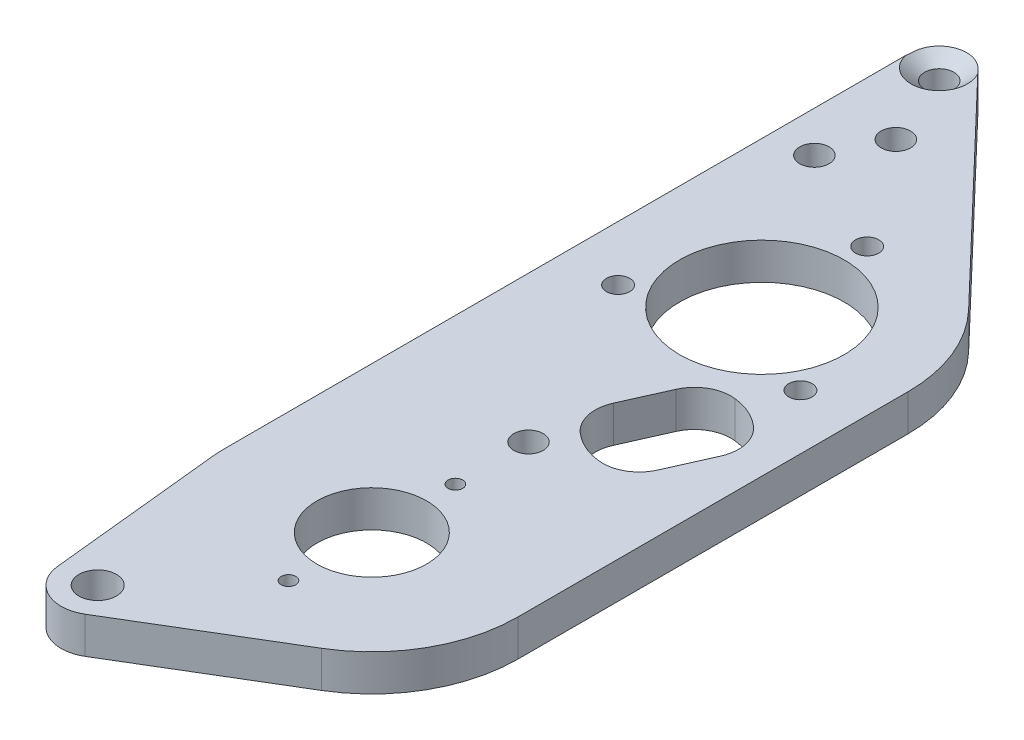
ISO-10303-21;
HEADER;
FILE_DESCRIPTION(('STEP AP214'),'2;1');
FILE_NAME('part.step','',(''),(''),'','','');
FILE_SCHEMA(('AUTOMOTIVE_DESIGN { 1 0 10303 214 1 1 1 1 }'));
ENDSEC;
DATA;
#1=APPLICATION_CONTEXT('core data for automotive mechanical design processes');
#2=APPLICATION_PROTOCOL_DEFINITION('international standard','automotive_design',2000,#1);
#3=PRODUCT_CONTEXT('',#1,'mechanical');
#4=PRODUCT('Part','Part','',(#3));
#5=PRODUCT_RELATED_PRODUCT_CATEGORY('part','',(#4));
#6=PRODUCT_DEFINITION_FORMATION('','',#4);
#7=PRODUCT_DEFINITION_CONTEXT('part definition',#1,'design');
#8=PRODUCT_DEFINITION('design','',#6,#7);
#9=PRODUCT_DEFINITION_SHAPE('','',#8);
#10=(LENGTH_UNIT() NAMED_UNIT(*) SI_UNIT(.MILLI.,.METRE.));
#11=(NAMED_UNIT(*) PLANE_ANGLE_UNIT() SI_UNIT($,.RADIAN.));
#12=(NAMED_UNIT(*) SI_UNIT($,.STERADIAN.) SOLID_ANGLE_UNIT());
#13=UNCERTAINTY_MEASURE_WITH_UNIT(LENGTH_MEASURE(1.E-05),#10,'distance_accuracy_value','');
#14=(GEOMETRIC_REPRESENTATION_CONTEXT(3) GLOBAL_UNCERTAINTY_ASSIGNED_CONTEXT((#13)) GLOBAL_UNIT_ASSIGNED_CONTEXT((#10,
#11,#12)) REPRESENTATION_CONTEXT('',''));
#15=CARTESIAN_POINT('',(0.,0.,0.));
#16=DIRECTION('',(0.,0.,1.));
#17=DIRECTION('',(1.,0.,0.));
#18=AXIS2_PLACEMENT_3D('',#15,#16,#17);
#19=CARTESIAN_POINT('',(0.,6.35,0.));
#20=DIRECTION('',(0.,1.,0.));
#21=DIRECTION('',(0.,0.,1.));
#22=AXIS2_PLACEMENT_3D('',#19,#20,#21);
#23=PLANE('',#22);
#24=CARTESIAN_POINT('',(9.5621274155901,6.35,55.6767999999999));
#25=DIRECTION('',(0.,1.,0.));
#26=DIRECTION('',(0.,0.,1.));
#27=AXIS2_PLACEMENT_3D('',#24,#25,#26);
#28=CIRCLE('',#27,2.01929999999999);
#29=CARTESIAN_POINT('',(9.5621274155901,6.35,57.6960999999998));
#30=VERTEX_POINT('',#29);
#31=EDGE_CURVE('E865',#30,#30,#28,.T.);
#32=ORIENTED_EDGE('',*,*,#31,.F.);
#33=EDGE_LOOP('',(#32));
#34=FACE_BOUND('',#33,.T.);
#35=CARTESIAN_POINT('',(25.4,6.35,28.2448));
#36=DIRECTION('',(0.,1.,0.));
#37=DIRECTION('',(0.,0.,1.));
#38=AXIS2_PLACEMENT_3D('',#35,#36,#37);
#39=CIRCLE('',#38,2.01929999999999);
#40=CARTESIAN_POINT('',(25.4,6.35,30.2641));
#41=VERTEX_POINT('',#40);
#42=EDGE_CURVE('E859',#41,#41,#39,.T.);
#43=ORIENTED_EDGE('',*,*,#42,.F.);
#44=EDGE_LOOP('',(#43));
#45=FACE_BOUND('',#44,.T.);
#46=CARTESIAN_POINT('',(41.2378725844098,6.35,55.6768000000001));
#47=DIRECTION('',(0.,1.,0.));
#48=DIRECTION('',(0.,0.,1.));
#49=AXIS2_PLACEMENT_3D('',#46,#47,#48);
#50=CIRCLE('',#49,2.01929999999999);
#51=CARTESIAN_POINT('',(41.2378725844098,6.35,57.6961000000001));
#52=VERTEX_POINT('',#51);
#53=EDGE_CURVE('E853',#52,#52,#50,.T.);
#54=ORIENTED_EDGE('',*,*,#53,.F.);
#55=EDGE_LOOP('',(#54));
#56=FACE_BOUND('',#55,.T.);
#57=DIRECTION('',(0.406736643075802,0.,-0.9135454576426));
#58=VECTOR('',#57,1.);
#59=CARTESIAN_POINT('',(31.6354975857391,6.35,63.2828955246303));
#60=LINE('',#59,#58);
#61=CARTESIAN_POINT('',(26.9201768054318,6.35,73.8736793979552));
#62=VERTEX_POINT('',#61);
#63=CARTESIAN_POINT('',(30.277390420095,6.35,66.3332541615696));
#64=VERTEX_POINT('',#63);
#65=EDGE_CURVE('E224',#62,#64,#60,.T.);
#66=ORIENTED_EDGE('',*,*,#65,.T.);
#67=CARTESIAN_POINT('',(36.0784040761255,6.35,68.916031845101));
#68=DIRECTION('',(0.,1.,0.));
#69=DIRECTION('',(0.,0.,1.));
#70=AXIS2_PLACEMENT_3D('',#67,#68,#69);
#71=CIRCLE('',#70,6.35);
#72=CARTESIAN_POINT('',(36.8407630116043,6.35,62.611961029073));
#73=VERTEX_POINT('',#72);
#74=EDGE_CURVE('E12',#64,#73,#71,.F.);
#75=ORIENTED_EDGE('',*,*,#74,.T.);
#76=CARTESIAN_POINT('',(35.56,6.35,73.2028));
#77=DIRECTION('',(0.,-1.,0.));
#78=DIRECTION('',(0.,0.,-1.));
#79=AXIS2_PLACEMENT_3D('',#76,#77,#78);
#80=CIRCLE('',#79,10.668);
#81=CARTESIAN_POINT('',(42.573529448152,6.35,65.1643530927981));
#82=VERTEX_POINT('',#81);
#83=EDGE_CURVE('E821',#73,#82,#80,.T.);
#84=ORIENTED_EDGE('',*,*,#83,.T.);
#85=CARTESIAN_POINT('',(38.3988095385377,6.35,69.9491429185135));
#86=DIRECTION('',(0.,1.,0.));
#87=DIRECTION('',(0.,0.,1.));
#88=AXIS2_PLACEMENT_3D('',#85,#86,#87);
#89=CIRCLE('',#88,6.35);
#90=CARTESIAN_POINT('',(44.1998231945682,6.35,72.5319206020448));
#91=VERTEX_POINT('',#90);
#92=EDGE_CURVE('E797',#82,#91,#89,.F.);
#93=ORIENTED_EDGE('',*,*,#92,.T.);
#94=DIRECTION('',(-0.406736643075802,0.,0.9135454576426));
#95=VECTOR('',#94,1.);
#96=CARTESIAN_POINT('',(39.4845024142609,6.35,83.1227044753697));
#97=LINE('',#96,#95);
#98=CARTESIAN_POINT('',(40.842609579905,6.35,80.0723458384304));
#99=VERTEX_POINT('',#98);
#100=EDGE_CURVE('E835',#91,#99,#97,.T.);
#101=ORIENTED_EDGE('',*,*,#100,.T.);
#102=CARTESIAN_POINT('',(35.0415959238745,6.35,77.489568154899));
#103=DIRECTION('',(0.,1.,0.));
#104=DIRECTION('',(0.,0.,1.));
#105=AXIS2_PLACEMENT_3D('',#102,#103,#104);
#106=CIRCLE('',#105,6.35);
#107=CARTESIAN_POINT('',(34.2792369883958,6.35,83.793638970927));
#108=VERTEX_POINT('',#107);
#109=EDGE_CURVE('E809',#99,#108,#106,.F.);
#110=ORIENTED_EDGE('',*,*,#109,.T.);
#111=CARTESIAN_POINT('',(35.56,6.35,73.2028));
#112=DIRECTION('',(0.,-1.,0.));
#113=DIRECTION('',(0.,0.,-1.));
#114=AXIS2_PLACEMENT_3D('',#111,#112,#113);
#115=CIRCLE('',#114,10.668);
#116=CARTESIAN_POINT('',(28.546470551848,6.35,81.2412469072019));
#117=VERTEX_POINT('',#116);
#118=EDGE_CURVE('E839',#108,#117,#115,.T.);
#119=ORIENTED_EDGE('',*,*,#118,.T.);
#120=CARTESIAN_POINT('',(32.7211904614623,6.35,76.4564570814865));
#121=DIRECTION('',(0.,1.,0.));
#122=DIRECTION('',(0.,0.,1.));
#123=AXIS2_PLACEMENT_3D('',#120,#121,#122);
#124=CIRCLE('',#123,6.35);
#125=EDGE_CURVE('E800',#117,#62,#124,.F.);
#126=ORIENTED_EDGE('',*,*,#125,.T.);
#127=EDGE_LOOP('',(#66,#75,#84,#93,#101,#110,#119,#126));
#128=FACE_BOUND('',#127,.T.);
#129=CARTESIAN_POINT('',(4.7625,6.35,-4.91366699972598));
#130=DIRECTION('',(0.,1.,0.));
#131=DIRECTION('',(0.,0.,1.));
#132=AXIS2_PLACEMENT_3D('',#129,#130,#131);
#133=CIRCLE('',#132,4.8895);
#134=CARTESIAN_POINT('',(0.,6.35,-3.80650666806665));
#135=VERTEX_POINT('',#134);
#136=CARTESIAN_POINT('',(8.96985761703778,6.35,-7.40472142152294));
#137=VERTEX_POINT('',#136);
#138=EDGE_CURVE('E206',#135,#137,#133,.T.);
#139=ORIENTED_EDGE('',*,*,#138,.F.);
#140=DIRECTION('',(0.,0.,1.));
#141=VECTOR('',#140,1.);
#142=CARTESIAN_POINT('',(0.,6.35,0.));
#143=LINE('',#142,#141);
#144=CARTESIAN_POINT('',(0.,6.35,114.3));
#145=VERTEX_POINT('',#144);
#146=EDGE_CURVE('E219',#135,#145,#143,.T.);
#147=ORIENTED_EDGE('',*,*,#146,.T.);
#148=CARTESIAN_POINT('',(25.4,6.35,114.3));
#149=DIRECTION('',(0.,-1.,0.));
#150=DIRECTION('',(0.,0.,-1.));
#151=AXIS2_PLACEMENT_3D('',#148,#149,#150);
#152=CIRCLE('',#151,25.4);
#153=CARTESIAN_POINT('',(0.134150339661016,6.35,116.90707516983));
#154=VERTEX_POINT('',#153);
#155=EDGE_CURVE('E411',#154,#145,#152,.T.);
#156=ORIENTED_EDGE('',*,*,#155,.F.);
#157=DIRECTION('',(-0.102640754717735,0.,-0.994718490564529));
#158=VECTOR('',#157,1.);
#159=CARTESIAN_POINT('',(-11.8033182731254,6.35,1.21793402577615));
#160=LINE('',#159,#158);
#161=CARTESIAN_POINT('',(3.20853758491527,6.35,146.701768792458));
#162=VERTEX_POINT('',#161);
#163=EDGE_CURVE('E418',#162,#154,#160,.T.);
#164=ORIENTED_EDGE('',*,*,#163,.F.);
#165=CARTESIAN_POINT('',(9.52500000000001,6.35,146.05));
#166=DIRECTION('',(0.,-1.,0.));
#167=DIRECTION('',(0.,0.,-1.));
#168=AXIS2_PLACEMENT_3D('',#165,#166,#167);
#169=CIRCLE('',#168,6.35000000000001);
#170=CARTESIAN_POINT('',(12.7934624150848,6.35,151.494231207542));
#171=VERTEX_POINT('',#170);
#172=EDGE_CURVE('E424',#171,#162,#169,.T.);
#173=ORIENTED_EDGE('',*,*,#172,.F.);
#174=DIRECTION('',(0.857359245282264,0.,-0.514718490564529));
#175=VECTOR('',#174,1.);
#176=CARTESIAN_POINT('',(70.2436382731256,6.35,117.003825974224));
#177=LINE('',#176,#175);
#178=CARTESIAN_POINT('',(38.473849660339,6.35,136.07692483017));
#179=VERTEX_POINT('',#178);
#180=EDGE_CURVE('E427',#171,#179,#177,.T.);
#181=ORIENTED_EDGE('',*,*,#180,.T.);
#182=CARTESIAN_POINT('',(25.4,6.35,114.3));
#183=DIRECTION('',(0.,-1.,0.));
#184=DIRECTION('',(0.,0.,-1.));
#185=AXIS2_PLACEMENT_3D('',#182,#183,#184);
#186=CIRCLE('',#185,25.4);
#187=CARTESIAN_POINT('',(50.8,6.35,114.3));
#188=VERTEX_POINT('',#187);
#189=EDGE_CURVE('E422',#188,#179,#186,.T.);
#190=ORIENTED_EDGE('',*,*,#189,.F.);
#191=DIRECTION('',(0.,0.,-1.));
#192=VECTOR('',#191,1.);
#193=CARTESIAN_POINT('',(50.8,6.35,0.));
#194=LINE('',#193,#192);
#195=CARTESIAN_POINT('',(50.8,6.35,46.5328));
#196=VERTEX_POINT('',#195);
#197=EDGE_CURVE('E231',#188,#196,#194,.T.);
#198=ORIENTED_EDGE('',*,*,#197,.T.);
#199=CARTESIAN_POINT('',(25.4,6.35,46.5328));
#200=DIRECTION('',(0.,-1.,0.));
#201=DIRECTION('',(0.,0.,-1.));
#202=AXIS2_PLACEMENT_3D('',#199,#200,#201);
#203=CIRCLE('',#202,25.4);
#204=CARTESIAN_POINT('',(43.7584957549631,6.35,28.9792922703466));
#205=VERTEX_POINT('',#204);
#206=EDGE_CURVE('E397',#205,#196,#203,.T.);
#207=ORIENTED_EDGE('',*,*,#206,.F.);
#208=DIRECTION('',(-0.691082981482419,0.,-0.722775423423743));
#209=VECTOR('',#208,1.);
#210=CARTESIAN_POINT('',(8.38453432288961,6.35,-8.01688711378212));
#211=LINE('',#210,#209);
#212=EDGE_CURVE('E223',#205,#137,#211,.T.);
#213=ORIENTED_EDGE('',*,*,#212,.T.);
#214=EDGE_LOOP('',(#139,#147,#156,#164,#173,#181,#190,#198,#207,#213));
#215=FACE_BOUND('',#214,.T.);
#216=CARTESIAN_POINT('',(25.4,6.35,87.07882));
#217=DIRECTION('',(0.,-1.,0.));
#218=DIRECTION('',(0.,0.,-1.));
#219=AXIS2_PLACEMENT_3D('',#216,#217,#218);
#220=CIRCLE('',#219,2.55269999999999);
#221=CARTESIAN_POINT('',(25.4,6.35,84.52612));
#222=VERTEX_POINT('',#221);
#223=EDGE_CURVE('E444',#222,#222,#220,.T.);
#224=ORIENTED_EDGE('',*,*,#223,.T.);
#225=EDGE_LOOP('',(#224));
#226=FACE_BOUND('',#225,.T.);
#227=CARTESIAN_POINT('',(25.4,6.35,99.77882));
#228=DIRECTION('',(0.,-1.,0.));
#229=DIRECTION('',(0.,0.,-1.));
#230=AXIS2_PLACEMENT_3D('',#227,#228,#229);
#231=CIRCLE('',#230,1.27000000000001);
#232=CARTESIAN_POINT('',(25.4,6.35,98.50882));
#233=VERTEX_POINT('',#232);
#234=EDGE_CURVE('E450',#233,#233,#231,.T.);
#235=ORIENTED_EDGE('',*,*,#234,.T.);
#236=EDGE_LOOP('',(#235));
#237=FACE_BOUND('',#236,.T.);
#238=CARTESIAN_POINT('',(25.4,6.35,128.778));
#239=DIRECTION('',(0.,-1.,0.));
#240=DIRECTION('',(0.,0.,-1.));
#241=AXIS2_PLACEMENT_3D('',#238,#239,#240);
#242=CIRCLE('',#241,1.27000000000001);
#243=CARTESIAN_POINT('',(25.4,6.35,127.508));
#244=VERTEX_POINT('',#243);
#245=EDGE_CURVE('E456',#244,#244,#242,.T.);
#246=ORIENTED_EDGE('',*,*,#245,.T.);
#247=EDGE_LOOP('',(#246));
#248=FACE_BOUND('',#247,.T.);
#249=CARTESIAN_POINT('',(7.09951582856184,6.35,19.108793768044));
#250=DIRECTION('',(0.,1.,0.));
#251=DIRECTION('',(0.,0.,1.));
#252=AXIS2_PLACEMENT_3D('',#249,#250,#251);
#253=CIRCLE('',#252,2.5527);
#254=CARTESIAN_POINT('',(7.09951582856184,6.35,21.661493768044));
#255=VERTEX_POINT('',#254);
#256=EDGE_CURVE('E467',#255,#255,#253,.T.);
#257=ORIENTED_EDGE('',*,*,#256,.F.);
#258=EDGE_LOOP('',(#257));
#259=FACE_BOUND('',#258,.T.);
#260=CARTESIAN_POINT('',(11.7863080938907,6.35,9.652));
#261=DIRECTION('',(0.,1.,0.));
#262=DIRECTION('',(0.,0.,1.));
#263=AXIS2_PLACEMENT_3D('',#260,#261,#262);
#264=CIRCLE('',#263,2.5527);
#265=CARTESIAN_POINT('',(11.7863080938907,6.35,12.2047));
#266=VERTEX_POINT('',#265);
#267=EDGE_CURVE('E473',#266,#266,#264,.T.);
#268=ORIENTED_EDGE('',*,*,#267,.F.);
#269=EDGE_LOOP('',(#268));
#270=FACE_BOUND('',#269,.T.);
#271=CARTESIAN_POINT('',(9.52500000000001,6.35,146.05));
#272=DIRECTION('',(0.,1.,0.));
#273=DIRECTION('',(0.,0.,1.));
#274=AXIS2_PLACEMENT_3D('',#271,#272,#273);
#275=CIRCLE('',#274,3.26389999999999);
#276=CARTESIAN_POINT('',(9.52500000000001,6.35,149.3139));
#277=VERTEX_POINT('',#276);
#278=EDGE_CURVE('E254',#277,#277,#275,.T.);
#279=ORIENTED_EDGE('',*,*,#278,.F.);
#280=EDGE_LOOP('',(#279));
#281=FACE_BOUND('',#280,.T.);
#282=CARTESIAN_POINT('',(25.4,6.35,114.3));
#283=DIRECTION('',(0.,1.,0.));
#284=DIRECTION('',(0.,0.,1.));
#285=AXIS2_PLACEMENT_3D('',#282,#283,#284);
#286=CIRCLE('',#285,9.52500000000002);
#287=CARTESIAN_POINT('',(25.4,6.35,123.825));
#288=VERTEX_POINT('',#287);
#289=EDGE_CURVE('E480',#288,#288,#286,.T.);
#290=ORIENTED_EDGE('',*,*,#289,.F.);
#291=EDGE_LOOP('',(#290));
#292=FACE_BOUND('',#291,.T.);
#293=CARTESIAN_POINT('',(25.4,6.35,46.5328));
#294=DIRECTION('',(0.,1.,0.));
#295=DIRECTION('',(0.,0.,1.));
#296=AXIS2_PLACEMENT_3D('',#293,#294,#295);
#297=CIRCLE('',#296,14.2875);
#298=CARTESIAN_POINT('',(25.4,6.35,60.8203));
#299=VERTEX_POINT('',#298);
#300=EDGE_CURVE('E236',#299,#299,#297,.T.);
#301=ORIENTED_EDGE('',*,*,#300,.F.);
#302=EDGE_LOOP('',(#301));
#303=FACE_BOUND('',#302,.T.);
#304=ADVANCED_FACE('F72',(#34,#45,#56,#128,#215,#226,#237,#248,#259,#270,#281,#292,#303),#23,.T.);
#305=CARTESIAN_POINT('',(0.,0.,0.));
#306=DIRECTION('',(0.,1.,0.));
#307=DIRECTION('',(0.,0.,1.));
#308=AXIS2_PLACEMENT_3D('',#305,#306,#307);
#309=PLANE('',#308);
#310=CARTESIAN_POINT('',(9.5621274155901,0.,55.6767999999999));
#311=DIRECTION('',(0.,1.,0.));
#312=DIRECTION('',(0.,0.,1.));
#313=AXIS2_PLACEMENT_3D('',#310,#311,#312);
#314=CIRCLE('',#313,2.0193);
#315=CARTESIAN_POINT('',(9.5621274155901,0.,57.6960999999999));
#316=VERTEX_POINT('',#315);
#317=EDGE_CURVE('E862',#316,#316,#314,.T.);
#318=ORIENTED_EDGE('',*,*,#317,.T.);
#319=EDGE_LOOP('',(#318));
#320=FACE_BOUND('',#319,.T.);
#321=CARTESIAN_POINT('',(25.4,0.,28.2448));
#322=DIRECTION('',(0.,1.,0.));
#323=DIRECTION('',(0.,0.,1.));
#324=AXIS2_PLACEMENT_3D('',#321,#322,#323);
#325=CIRCLE('',#324,2.0193);
#326=CARTESIAN_POINT('',(25.4,0.,30.2641));
#327=VERTEX_POINT('',#326);
#328=EDGE_CURVE('E856',#327,#327,#325,.T.);
#329=ORIENTED_EDGE('',*,*,#328,.T.);
#330=EDGE_LOOP('',(#329));
#331=FACE_BOUND('',#330,.T.);
#332=CARTESIAN_POINT('',(41.2378725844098,0.,55.6768000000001));
#333=DIRECTION('',(0.,1.,0.));
#334=DIRECTION('',(0.,0.,1.));
#335=AXIS2_PLACEMENT_3D('',#332,#333,#334);
#336=CIRCLE('',#335,2.01929999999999);
#337=CARTESIAN_POINT('',(41.2378725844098,0.,57.6961000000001));
#338=VERTEX_POINT('',#337);
#339=EDGE_CURVE('E792',#338,#338,#336,.T.);
#340=ORIENTED_EDGE('',*,*,#339,.T.);
#341=EDGE_LOOP('',(#340));
#342=FACE_BOUND('',#341,.T.);
#343=DIRECTION('',(-0.406736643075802,0.,0.9135454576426));
#344=VECTOR('',#343,1.);
#345=CARTESIAN_POINT('',(39.4845024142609,0.,83.1227044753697));
#346=LINE('',#345,#344);
#347=CARTESIAN_POINT('',(44.1998231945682,0.,72.5319206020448));
#348=VERTEX_POINT('',#347);
#349=CARTESIAN_POINT('',(40.842609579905,0.,80.0723458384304));
#350=VERTEX_POINT('',#349);
#351=EDGE_CURVE('E791',#348,#350,#346,.T.);
#352=ORIENTED_EDGE('',*,*,#351,.F.);
#353=CARTESIAN_POINT('',(38.3988095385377,0.,69.9491429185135));
#354=DIRECTION('',(0.,1.,0.));
#355=DIRECTION('',(0.,0.,1.));
#356=AXIS2_PLACEMENT_3D('',#353,#354,#355);
#357=CIRCLE('',#356,6.35);
#358=CARTESIAN_POINT('',(42.573529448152,0.,65.1643530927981));
#359=VERTEX_POINT('',#358);
#360=EDGE_CURVE('E795',#348,#359,#357,.T.);
#361=ORIENTED_EDGE('',*,*,#360,.T.);
#362=CARTESIAN_POINT('',(35.56,0.,73.2028));
#363=DIRECTION('',(0.,-1.,0.));
#364=DIRECTION('',(0.,0.,-1.));
#365=AXIS2_PLACEMENT_3D('',#362,#363,#364);
#366=CIRCLE('',#365,10.668);
#367=CARTESIAN_POINT('',(36.8407630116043,0.,62.611961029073));
#368=VERTEX_POINT('',#367);
#369=EDGE_CURVE('E787',#368,#359,#366,.T.);
#370=ORIENTED_EDGE('',*,*,#369,.F.);
#371=CARTESIAN_POINT('',(36.0784040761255,0.,68.916031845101));
#372=DIRECTION('',(0.,1.,0.));
#373=DIRECTION('',(0.,0.,1.));
#374=AXIS2_PLACEMENT_3D('',#371,#372,#373);
#375=CIRCLE('',#374,6.35);
#376=CARTESIAN_POINT('',(30.277390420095,0.,66.3332541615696));
#377=VERTEX_POINT('',#376);
#378=EDGE_CURVE('E80',#368,#377,#375,.T.);
#379=ORIENTED_EDGE('',*,*,#378,.T.);
#380=DIRECTION('',(0.406736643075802,0.,-0.9135454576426));
#381=VECTOR('',#380,1.);
#382=CARTESIAN_POINT('',(31.6354975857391,0.,63.2828955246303));
#383=LINE('',#382,#381);
#384=CARTESIAN_POINT('',(26.9201768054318,0.,73.8736793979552));
#385=VERTEX_POINT('',#384);
#386=EDGE_CURVE('E815',#385,#377,#383,.T.);
#387=ORIENTED_EDGE('',*,*,#386,.F.);
#388=CARTESIAN_POINT('',(32.7211904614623,0.,76.4564570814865));
#389=DIRECTION('',(0.,1.,0.));
#390=DIRECTION('',(0.,0.,1.));
#391=AXIS2_PLACEMENT_3D('',#388,#389,#390);
#392=CIRCLE('',#391,6.35);
#393=CARTESIAN_POINT('',(28.546470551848,0.,81.2412469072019));
#394=VERTEX_POINT('',#393);
#395=EDGE_CURVE('E798',#385,#394,#392,.T.);
#396=ORIENTED_EDGE('',*,*,#395,.T.);
#397=CARTESIAN_POINT('',(35.56,0.,73.2028));
#398=DIRECTION('',(0.,-1.,0.));
#399=DIRECTION('',(0.,0.,-1.));
#400=AXIS2_PLACEMENT_3D('',#397,#398,#399);
#401=CIRCLE('',#400,10.668);
#402=CARTESIAN_POINT('',(34.2792369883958,0.,83.793638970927));
#403=VERTEX_POINT('',#402);
#404=EDGE_CURVE('E822',#403,#394,#401,.T.);
#405=ORIENTED_EDGE('',*,*,#404,.F.);
#406=CARTESIAN_POINT('',(35.0415959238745,0.,77.489568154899));
#407=DIRECTION('',(0.,1.,0.));
#408=DIRECTION('',(0.,0.,1.));
#409=AXIS2_PLACEMENT_3D('',#406,#407,#408);
#410=CIRCLE('',#409,6.35);
#411=EDGE_CURVE('E807',#403,#350,#410,.T.);
#412=ORIENTED_EDGE('',*,*,#411,.T.);
#413=EDGE_LOOP('',(#352,#361,#370,#379,#387,#396,#405,#412));
#414=FACE_BOUND('',#413,.T.);
#415=CARTESIAN_POINT('',(4.7625,0.,-4.91366699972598));
#416=DIRECTION('',(0.,-1.,0.));
#417=DIRECTION('',(0.,0.,-1.));
#418=AXIS2_PLACEMENT_3D('',#415,#416,#417);
#419=CIRCLE('',#418,2.5527);
#420=CARTESIAN_POINT('',(4.7625,0.,-7.46636699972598));
#421=VERTEX_POINT('',#420);
#422=EDGE_CURVE('E459',#421,#421,#419,.T.);
#423=ORIENTED_EDGE('',*,*,#422,.F.);
#424=EDGE_LOOP('',(#423));
#425=FACE_BOUND('',#424,.T.);
#426=CARTESIAN_POINT('',(25.4,0.,46.5328));
#427=DIRECTION('',(0.,1.,0.));
#428=DIRECTION('',(0.,0.,1.));
#429=AXIS2_PLACEMENT_3D('',#426,#427,#428);
#430=CIRCLE('',#429,14.2875);
#431=CARTESIAN_POINT('',(25.4,0.,60.8203));
#432=VERTEX_POINT('',#431);
#433=EDGE_CURVE('E247',#432,#432,#430,.T.);
#434=ORIENTED_EDGE('',*,*,#433,.T.);
#435=EDGE_LOOP('',(#434));
#436=FACE_BOUND('',#435,.T.);
#437=CARTESIAN_POINT('',(25.4,0.,114.3));
#438=DIRECTION('',(0.,1.,0.));
#439=DIRECTION('',(0.,0.,1.));
#440=AXIS2_PLACEMENT_3D('',#437,#438,#439);
#441=CIRCLE('',#440,9.52500000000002);
#442=CARTESIAN_POINT('',(25.4,0.,123.825));
#443=VERTEX_POINT('',#442);
#444=EDGE_CURVE('E243',#443,#443,#441,.T.);
#445=ORIENTED_EDGE('',*,*,#444,.T.);
#446=EDGE_LOOP('',(#445));
#447=FACE_BOUND('',#446,.T.);
#448=CARTESIAN_POINT('',(9.52500000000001,0.,146.05));
#449=DIRECTION('',(0.,1.,0.));
#450=DIRECTION('',(0.,0.,1.));
#451=AXIS2_PLACEMENT_3D('',#448,#449,#450);
#452=CIRCLE('',#451,3.26389999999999);
#453=CARTESIAN_POINT('',(9.52500000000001,0.,149.3139));
#454=VERTEX_POINT('',#453);
#455=EDGE_CURVE('E240',#454,#454,#452,.T.);
#456=ORIENTED_EDGE('',*,*,#455,.T.);
#457=EDGE_LOOP('',(#456));
#458=FACE_BOUND('',#457,.T.);
#459=CARTESIAN_POINT('',(11.7863080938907,0.,9.652));
#460=DIRECTION('',(0.,1.,0.));
#461=DIRECTION('',(0.,0.,1.));
#462=AXIS2_PLACEMENT_3D('',#459,#460,#461);
#463=CIRCLE('',#462,2.5527);
#464=CARTESIAN_POINT('',(11.7863080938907,0.,12.2047));
#465=VERTEX_POINT('',#464);
#466=EDGE_CURVE('E244',#465,#465,#463,.T.);
#467=ORIENTED_EDGE('',*,*,#466,.T.);
#468=EDGE_LOOP('',(#467));
#469=FACE_BOUND('',#468,.T.);
#470=CARTESIAN_POINT('',(7.09951582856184,0.,19.108793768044));
#471=DIRECTION('',(0.,1.,0.));
#472=DIRECTION('',(0.,0.,1.));
#473=AXIS2_PLACEMENT_3D('',#470,#471,#472);
#474=CIRCLE('',#473,2.5527);
#475=CARTESIAN_POINT('',(7.09951582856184,0.,21.661493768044));
#476=VERTEX_POINT('',#475);
#477=EDGE_CURVE('E470',#476,#476,#474,.T.);
#478=ORIENTED_EDGE('',*,*,#477,.T.);
#479=EDGE_LOOP('',(#478));
#480=FACE_BOUND('',#479,.T.);
#481=CARTESIAN_POINT('',(25.4,0.,128.778));
#482=DIRECTION('',(0.,-1.,0.));
#483=DIRECTION('',(0.,0.,-1.));
#484=AXIS2_PLACEMENT_3D('',#481,#482,#483);
#485=CIRCLE('',#484,1.27000000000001);
#486=CARTESIAN_POINT('',(25.4,0.,127.508));
#487=VERTEX_POINT('',#486);
#488=EDGE_CURVE('E453',#487,#487,#485,.T.);
#489=ORIENTED_EDGE('',*,*,#488,.F.);
#490=EDGE_LOOP('',(#489));
#491=FACE_BOUND('',#490,.T.);
#492=CARTESIAN_POINT('',(25.4,0.,99.77882));
#493=DIRECTION('',(0.,-1.,0.));
#494=DIRECTION('',(0.,0.,-1.));
#495=AXIS2_PLACEMENT_3D('',#492,#493,#494);
#496=CIRCLE('',#495,1.27000000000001);
#497=CARTESIAN_POINT('',(25.4,0.,98.50882));
#498=VERTEX_POINT('',#497);
#499=EDGE_CURVE('E447',#498,#498,#496,.T.);
#500=ORIENTED_EDGE('',*,*,#499,.F.);
#501=EDGE_LOOP('',(#500));
#502=FACE_BOUND('',#501,.T.);
#503=CARTESIAN_POINT('',(25.4,0.,87.07882));
#504=DIRECTION('',(0.,-1.,0.));
#505=DIRECTION('',(0.,0.,-1.));
#506=AXIS2_PLACEMENT_3D('',#503,#504,#505);
#507=CIRCLE('',#506,2.55269999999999);
#508=CARTESIAN_POINT('',(25.4,0.,84.52612));
#509=VERTEX_POINT('',#508);
#510=EDGE_CURVE('E439',#509,#509,#507,.T.);
#511=ORIENTED_EDGE('',*,*,#510,.F.);
#512=EDGE_LOOP('',(#511));
#513=FACE_BOUND('',#512,.T.);
#514=CARTESIAN_POINT('',(4.7625,0.,-4.91366699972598));
#515=DIRECTION('',(0.,-1.,0.));
#516=DIRECTION('',(0.,0.,-1.));
#517=AXIS2_PLACEMENT_3D('',#514,#515,#516);
#518=CIRCLE('',#517,4.7625);
#519=CARTESIAN_POINT('',(0.,0.,-4.91366699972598));
#520=VERTEX_POINT('',#519);
#521=CARTESIAN_POINT('',(8.20471795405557,0.,-8.204949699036));
#522=VERTEX_POINT('',#521);
#523=EDGE_CURVE('E395',#520,#522,#518,.T.);
#524=ORIENTED_EDGE('',*,*,#523,.T.);
#525=DIRECTION('',(-0.691082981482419,0.,-0.722775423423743));
#526=VECTOR('',#525,1.);
#527=CARTESIAN_POINT('',(8.38453432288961,0.,-8.01688711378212));
#528=LINE('',#527,#526);
#529=CARTESIAN_POINT('',(43.7584957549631,0.,28.9792922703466));
#530=VERTEX_POINT('',#529);
#531=EDGE_CURVE('E389',#530,#522,#528,.T.);
#532=ORIENTED_EDGE('',*,*,#531,.F.);
#533=CARTESIAN_POINT('',(25.4,0.,46.5328));
#534=DIRECTION('',(0.,-1.,0.));
#535=DIRECTION('',(0.,0.,-1.));
#536=AXIS2_PLACEMENT_3D('',#533,#534,#535);
#537=CIRCLE('',#536,25.4);
#538=CARTESIAN_POINT('',(50.8,0.,46.5328));
#539=VERTEX_POINT('',#538);
#540=EDGE_CURVE('E382',#530,#539,#537,.T.);
#541=ORIENTED_EDGE('',*,*,#540,.T.);
#542=DIRECTION('',(0.,0.,-1.));
#543=VECTOR('',#542,1.);
#544=CARTESIAN_POINT('',(50.8,0.,0.));
#545=LINE('',#544,#543);
#546=CARTESIAN_POINT('',(50.8,0.,114.3));
#547=VERTEX_POINT('',#546);
#548=EDGE_CURVE('E250',#547,#539,#545,.T.);
#549=ORIENTED_EDGE('',*,*,#548,.F.);
#550=CARTESIAN_POINT('',(25.4,0.,114.3));
#551=DIRECTION('',(0.,-1.,0.));
#552=DIRECTION('',(0.,0.,-1.));
#553=AXIS2_PLACEMENT_3D('',#550,#551,#552);
#554=CIRCLE('',#553,25.4);
#555=CARTESIAN_POINT('',(38.473849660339,0.,136.07692483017));
#556=VERTEX_POINT('',#555);
#557=EDGE_CURVE('E420',#547,#556,#554,.T.);
#558=ORIENTED_EDGE('',*,*,#557,.T.);
#559=DIRECTION('',(0.857359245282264,0.,-0.514718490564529));
#560=VECTOR('',#559,1.);
#561=CARTESIAN_POINT('',(70.2436382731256,0.,117.003825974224));
#562=LINE('',#561,#560);
#563=CARTESIAN_POINT('',(12.7934624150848,0.,151.494231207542));
#564=VERTEX_POINT('',#563);
#565=EDGE_CURVE('E425',#564,#556,#562,.T.);
#566=ORIENTED_EDGE('',*,*,#565,.F.);
#567=CARTESIAN_POINT('',(9.52500000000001,0.,146.05));
#568=DIRECTION('',(0.,-1.,0.));
#569=DIRECTION('',(0.,0.,-1.));
#570=AXIS2_PLACEMENT_3D('',#567,#568,#569);
#571=CIRCLE('',#570,6.35000000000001);
#572=CARTESIAN_POINT('',(3.20853758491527,0.,146.701768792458));
#573=VERTEX_POINT('',#572);
#574=EDGE_CURVE('E433',#564,#573,#571,.T.);
#575=ORIENTED_EDGE('',*,*,#574,.T.);
#576=DIRECTION('',(-0.102640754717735,0.,-0.994718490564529));
#577=VECTOR('',#576,1.);
#578=CARTESIAN_POINT('',(-11.8033182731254,0.,1.21793402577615));
#579=LINE('',#578,#577);
#580=CARTESIAN_POINT('',(0.134150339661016,0.,116.90707516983));
#581=VERTEX_POINT('',#580);
#582=EDGE_CURVE('E412',#573,#581,#579,.T.);
#583=ORIENTED_EDGE('',*,*,#582,.T.);
#584=CARTESIAN_POINT('',(25.4,0.,114.3));
#585=DIRECTION('',(0.,-1.,0.));
#586=DIRECTION('',(0.,0.,-1.));
#587=AXIS2_PLACEMENT_3D('',#584,#585,#586);
#588=CIRCLE('',#587,25.4);
#589=CARTESIAN_POINT('',(0.,0.,114.3));
#590=VERTEX_POINT('',#589);
#591=EDGE_CURVE('E403',#581,#590,#588,.T.);
#592=ORIENTED_EDGE('',*,*,#591,.T.);
#593=DIRECTION('',(0.,0.,1.));
#594=VECTOR('',#593,1.);
#595=CARTESIAN_POINT('',(0.,0.,0.));
#596=LINE('',#595,#594);
#597=EDGE_CURVE('E253',#520,#590,#596,.T.);
#598=ORIENTED_EDGE('',*,*,#597,.F.);
#599=EDGE_LOOP('',(#524,#532,#541,#549,#558,#566,#575,#583,#592,#598));
#600=FACE_BOUND('',#599,.T.);
#601=ADVANCED_FACE('F285',(#320,#331,#342,#414,#425,#436,#447,#458,#469,#480,#491,#502,#513,
#600),#309,.F.);
#602=CARTESIAN_POINT('',(50.8,6.35,0.));
#603=DIRECTION('',(-1.,0.,0.));
#604=DIRECTION('',(0.,0.,1.));
#605=AXIS2_PLACEMENT_3D('',#602,#603,#604);
#606=PLANE('',#605);
#607=DIRECTION('',(0.,-1.,0.));
#608=VECTOR('',#607,1.);
#609=CARTESIAN_POINT('',(50.8,6.35,46.5328));
#610=LINE('',#609,#608);
#611=EDGE_CURVE('E386',#196,#539,#610,.T.);
#612=ORIENTED_EDGE('',*,*,#611,.F.);
#613=ORIENTED_EDGE('',*,*,#197,.F.);
#614=DIRECTION('',(0.,-1.,0.));
#615=VECTOR('',#614,1.);
#616=CARTESIAN_POINT('',(50.8,6.35,114.3));
#617=LINE('',#616,#615);
#618=EDGE_CURVE('E430',#188,#547,#617,.T.);
#619=ORIENTED_EDGE('',*,*,#618,.T.);
#620=ORIENTED_EDGE('',*,*,#548,.T.);
#621=EDGE_LOOP('',(#612,#613,#619,#620));
#622=FACE_BOUND('',#621,.T.);
#623=ADVANCED_FACE('F284',(#622),#606,.F.);
#624=CARTESIAN_POINT('',(0.,6.35,0.));
#625=DIRECTION('',(1.,0.,0.));
#626=DIRECTION('',(0.,0.,-1.));
#627=AXIS2_PLACEMENT_3D('',#624,#625,#626);
#628=PLANE('',#627);
#629=ORIENTED_EDGE('',*,*,#146,.F.);
#630=CARTESIAN_POINT('',(0.,11.1681087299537,4.59145539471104));
#631=CARTESIAN_POINT('',(0.,11.0108290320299,4.3817790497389));
#632=CARTESIAN_POINT('',(0.,10.8541919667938,4.17161679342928));
#633=CARTESIAN_POINT('',(0.,10.5425192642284,3.75008846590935));
#634=CARTESIAN_POINT('',(0.,10.3874837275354,3.53872232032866));
#635=CARTESIAN_POINT('',(0.,10.0789919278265,3.11408751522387));
#636=CARTESIAN_POINT('',(0.,9.92554017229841,2.90081557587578));
#637=CARTESIAN_POINT('',(0.,9.62103891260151,2.4725686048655));
#638=CARTESIAN_POINT('',(0.,9.46998935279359,2.2575936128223));
#639=CARTESIAN_POINT('',(0.,9.16354623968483,1.81498026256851));
#640=CARTESIAN_POINT('',(0.,9.00830274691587,1.58723775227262));
#641=CARTESIAN_POINT('',(0.,8.70203360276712,1.12893632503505));
#642=CARTESIAN_POINT('',(0.,8.55100780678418,0.898377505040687));
#643=CARTESIAN_POINT('',(0.,8.25459143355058,0.433944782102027));
#644=CARTESIAN_POINT('',(0.,8.10919586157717,0.200074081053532));
#645=CARTESIAN_POINT('',(0.,7.82573809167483,-0.272051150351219));
#646=CARTESIAN_POINT('',(0.,7.68767478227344,-0.510305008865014));
#647=CARTESIAN_POINT('',(0.,7.42513261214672,-0.985759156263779));
#648=CARTESIAN_POINT('',(0.,7.30038548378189,-1.22281002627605));
#649=CARTESIAN_POINT('',(0.,7.0637430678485,-1.70347641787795));
#650=CARTESIAN_POINT('',(0.,6.95185421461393,-1.94709515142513));
#651=CARTESIAN_POINT('',(0.,6.7471653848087,-2.43908265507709));
#652=CARTESIAN_POINT('',(0.,6.65416114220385,-2.68736486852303));
#653=CARTESIAN_POINT('',(0.,6.49220942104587,-3.19150759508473));
#654=CARTESIAN_POINT('',(0.,6.42322743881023,-3.44735666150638));
#655=CARTESIAN_POINT('',(0.,6.32612784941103,-3.91843116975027));
#656=CARTESIAN_POINT('',(0.,6.29285590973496,-4.13256877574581));
#657=CARTESIAN_POINT('',(0.,6.25557790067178,-4.50903998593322));
#658=CARTESIAN_POINT('',(0.,6.24631593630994,-4.67085737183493));
#659=CARTESIAN_POINT('',(0.,6.24170507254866,-4.99472749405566));
#660=CARTESIAN_POINT('',(0.,6.24635840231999,-5.15678026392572));
#661=CARTESIAN_POINT('',(0.,6.26939109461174,-5.48102537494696));
#662=CARTESIAN_POINT('',(0.,6.28786580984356,-5.64321083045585));
#663=CARTESIAN_POINT('',(0.,6.33758560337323,-5.96555716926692));
#664=CARTESIAN_POINT('',(0.,6.36882963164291,-6.12571821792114));
#665=CARTESIAN_POINT('',(0.,6.46546177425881,-6.54202001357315));
#666=CARTESIAN_POINT('',(0.,6.54000596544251,-6.79603439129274));
#667=CARTESIAN_POINT('',(0.,6.71163409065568,-7.29665047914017));
#668=CARTESIAN_POINT('',(0.,6.80876381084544,-7.54323596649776));
#669=CARTESIAN_POINT('',(0.,6.96581952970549,-7.90560138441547));
#670=CARTESIAN_POINT('',(0.,7.01954796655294,-8.02413459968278));
#671=CARTESIAN_POINT('',(0.,7.13041024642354,-8.2596117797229));
#672=CARTESIAN_POINT('',(0.,7.18754432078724,-8.3765556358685));
#673=CARTESIAN_POINT('',(0.,7.30442020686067,-8.60840336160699));
#674=CARTESIAN_POINT('',(0.,7.36414779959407,-8.72331443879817));
#675=CARTESIAN_POINT('',(0.,7.48606100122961,-8.95178789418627));
#676=CARTESIAN_POINT('',(0.,7.54824595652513,-9.06535062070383));
#677=CARTESIAN_POINT('',(0.,7.6114707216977,-9.17832193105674));
#678=B_SPLINE_CURVE_WITH_KNOTS('',3,(#630,#631,#632,#633,#634,#635,#636,#637,#638,#639,#640,
#641,#642,#643,#644,#645,#646,#647,#648,#649,#650,#651,#652,#653,#654,#655,#656,#657,#658,#659,
#660,#661,#662,#663,#664,#665,#666,#667,#668,#669,#670,#671,#672,#673,#674,#675,#676,#677),
.UNSPECIFIED.,.F.,.F.,(4,2,2,2,2,2,2,2,2,2,2,2,2,2,2,2,2,2,2,2,2,2,2,4),(0.,0.786330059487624,
1.5727092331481,2.36091592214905,3.14910432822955,3.97593251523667,4.8027323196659,
5.62878101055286,6.45470412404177,7.2580372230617,8.06177057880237,8.85628332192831,
9.649650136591,10.2985246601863,10.7842044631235,11.2699620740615,11.7591021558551,
12.2482020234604,13.0408669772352,13.8351530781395,14.2255369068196,14.6159472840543,
15.0044361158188,15.3928223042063),.UNSPECIFIED.);
#679=CARTESIAN_POINT('',(0.,6.24343434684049,-4.91366699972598));
#680=VERTEX_POINT('',#679);
#681=EDGE_CURVE('E202',#135,#680,#678,.T.);
#682=ORIENTED_EDGE('',*,*,#681,.T.);
#683=DIRECTION('',(0.,-1.,0.));
#684=VECTOR('',#683,1.);
#685=CARTESIAN_POINT('',(0.,6.35,-4.91366699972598));
#686=LINE('',#685,#684);
#687=EDGE_CURVE('E465',#680,#520,#686,.T.);
#688=ORIENTED_EDGE('',*,*,#687,.T.);
#689=ORIENTED_EDGE('',*,*,#597,.T.);
#690=DIRECTION('',(0.,-1.,0.));
#691=VECTOR('',#690,1.);
#692=CARTESIAN_POINT('',(0.,6.35,114.3));
#693=LINE('',#692,#691);
#694=EDGE_CURVE('E229',#145,#590,#693,.T.);
#695=ORIENTED_EDGE('',*,*,#694,.F.);
#696=EDGE_LOOP('',(#629,#682,#688,#689,#695));
#697=FACE_BOUND('',#696,.T.);
#698=ADVANCED_FACE('F227',(#697),#628,.F.);
#699=CARTESIAN_POINT('',(25.4,6.35,46.5328));
#700=DIRECTION('',(0.,-1.,0.));
#701=DIRECTION('',(0.,0.,-1.));
#702=AXIS2_PLACEMENT_3D('',#699,#700,#701);
#703=CYLINDRICAL_SURFACE('',#702,14.2875);
#704=ORIENTED_EDGE('',*,*,#300,.T.);
#705=EDGE_LOOP('',(#704));
#706=FACE_BOUND('',#705,.T.);
#707=ORIENTED_EDGE('',*,*,#433,.F.);
#708=EDGE_LOOP('',(#707));
#709=FACE_BOUND('',#708,.T.);
#710=ADVANCED_FACE('F283',(#706,#709),#703,.F.);
#711=CARTESIAN_POINT('',(25.4,6.35,114.3));
#712=DIRECTION('',(0.,-1.,0.));
#713=DIRECTION('',(0.,0.,-1.));
#714=AXIS2_PLACEMENT_3D('',#711,#712,#713);
#715=CYLINDRICAL_SURFACE('',#714,9.52500000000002);
#716=ORIENTED_EDGE('',*,*,#289,.T.);
#717=EDGE_LOOP('',(#716));
#718=FACE_BOUND('',#717,.T.);
#719=ORIENTED_EDGE('',*,*,#444,.F.);
#720=EDGE_LOOP('',(#719));
#721=FACE_BOUND('',#720,.T.);
#722=ADVANCED_FACE('F292',(#718,#721),#715,.F.);
#723=CARTESIAN_POINT('',(9.52500000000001,6.35,146.05));
#724=DIRECTION('',(0.,-1.,0.));
#725=DIRECTION('',(0.,0.,-1.));
#726=AXIS2_PLACEMENT_3D('',#723,#724,#725);
#727=CYLINDRICAL_SURFACE('',#726,3.26389999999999);
#728=ORIENTED_EDGE('',*,*,#278,.T.);
#729=EDGE_LOOP('',(#728));
#730=FACE_BOUND('',#729,.T.);
#731=ORIENTED_EDGE('',*,*,#455,.F.);
#732=EDGE_LOOP('',(#731));
#733=FACE_BOUND('',#732,.T.);
#734=ADVANCED_FACE('F296',(#730,#733),#727,.F.);
#735=CARTESIAN_POINT('',(11.7863080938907,6.35,9.652));
#736=DIRECTION('',(0.,1.,0.));
#737=DIRECTION('',(0.,0.,1.));
#738=AXIS2_PLACEMENT_3D('',#735,#736,#737);
#739=CYLINDRICAL_SURFACE('',#738,2.5527);
#740=ORIENTED_EDGE('',*,*,#466,.F.);
#741=EDGE_LOOP('',(#740));
#742=FACE_BOUND('',#741,.T.);
#743=ORIENTED_EDGE('',*,*,#267,.T.);
#744=EDGE_LOOP('',(#743));
#745=FACE_BOUND('',#744,.T.);
#746=ADVANCED_FACE('F300',(#742,#745),#739,.F.);
#747=CARTESIAN_POINT('',(7.09951582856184,6.35,19.108793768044));
#748=DIRECTION('',(0.,1.,0.));
#749=DIRECTION('',(0.,0.,1.));
#750=AXIS2_PLACEMENT_3D('',#747,#748,#749);
#751=CYLINDRICAL_SURFACE('',#750,2.5527);
#752=ORIENTED_EDGE('',*,*,#477,.F.);
#753=EDGE_LOOP('',(#752));
#754=FACE_BOUND('',#753,.T.);
#755=ORIENTED_EDGE('',*,*,#256,.T.);
#756=EDGE_LOOP('',(#755));
#757=FACE_BOUND('',#756,.T.);
#758=ADVANCED_FACE('F330',(#754,#757),#751,.F.);
#759=CARTESIAN_POINT('',(4.7625,6.35,-4.91366699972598));
#760=DIRECTION('',(0.,-1.,0.));
#761=DIRECTION('',(0.,0.,-1.));
#762=AXIS2_PLACEMENT_3D('',#759,#760,#761);
#763=CYLINDRICAL_SURFACE('',#762,2.5527);
#764=CARTESIAN_POINT('',(4.7625,4.38919198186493,-4.91366699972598));
#765=DIRECTION('',(0.,1.,0.));
#766=DIRECTION('',(0.,0.,1.));
#767=AXIS2_PLACEMENT_3D('',#764,#765,#766);
#768=CIRCLE('',#767,2.5527);
#769=CARTESIAN_POINT('',(4.7625,4.38919198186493,-2.36096699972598));
#770=VERTEX_POINT('',#769);
#771=EDGE_CURVE('E213',#770,#770,#768,.T.);
#772=ORIENTED_EDGE('',*,*,#771,.T.);
#773=EDGE_LOOP('',(#772));
#774=FACE_BOUND('',#773,.T.);
#775=ORIENTED_EDGE('',*,*,#422,.T.);
#776=EDGE_LOOP('',(#775));
#777=FACE_BOUND('',#776,.T.);
#778=ADVANCED_FACE('F334',(#774,#777),#763,.F.);
#779=CARTESIAN_POINT('',(4.7625,6.35,-4.91366699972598));
#780=DIRECTION('',(0.,-1.,0.));
#781=DIRECTION('',(0.,0.,-1.));
#782=AXIS2_PLACEMENT_3D('',#779,#780,#781);
#783=CYLINDRICAL_SURFACE('',#782,4.7625);
#784=CARTESIAN_POINT('',(4.7625,6.24343434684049,-4.91366699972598));
#785=DIRECTION('',(0.,1.,0.));
#786=DIRECTION('',(0.,0.,1.));
#787=AXIS2_PLACEMENT_3D('',#784,#785,#786);
#788=CIRCLE('',#787,4.7625);
#789=CARTESIAN_POINT('',(8.20471795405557,6.24343434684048,-8.204949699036));
#790=VERTEX_POINT('',#789);
#791=EDGE_CURVE('E209',#790,#680,#788,.T.);
#792=ORIENTED_EDGE('',*,*,#791,.F.);
#793=DIRECTION('',(0.,-1.,0.));
#794=VECTOR('',#793,1.);
#795=CARTESIAN_POINT('',(8.20471795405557,6.35,-8.204949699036));
#796=LINE('',#795,#794);
#797=EDGE_CURVE('E401',#790,#522,#796,.T.);
#798=ORIENTED_EDGE('',*,*,#797,.T.);
#799=ORIENTED_EDGE('',*,*,#523,.F.);
#800=ORIENTED_EDGE('',*,*,#687,.F.);
#801=EDGE_LOOP('',(#792,#798,#799,#800));
#802=FACE_BOUND('',#801,.T.);
#803=ADVANCED_FACE('F338',(#802),#783,.T.);
#804=CARTESIAN_POINT('',(25.4,6.35,128.778));
#805=DIRECTION('',(0.,-1.,0.));
#806=DIRECTION('',(0.,0.,-1.));
#807=AXIS2_PLACEMENT_3D('',#804,#805,#806);
#808=CYLINDRICAL_SURFACE('',#807,1.27000000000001);
#809=ORIENTED_EDGE('',*,*,#245,.F.);
#810=EDGE_LOOP('',(#809));
#811=FACE_BOUND('',#810,.T.);
#812=ORIENTED_EDGE('',*,*,#488,.T.);
#813=EDGE_LOOP('',(#812));
#814=FACE_BOUND('',#813,.T.);
#815=ADVANCED_FACE('F342',(#811,#814),#808,.F.);
#816=CARTESIAN_POINT('',(25.4,6.35,99.77882));
#817=DIRECTION('',(0.,-1.,0.));
#818=DIRECTION('',(0.,0.,-1.));
#819=AXIS2_PLACEMENT_3D('',#816,#817,#818);
#820=CYLINDRICAL_SURFACE('',#819,1.27000000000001);
#821=ORIENTED_EDGE('',*,*,#234,.F.);
#822=EDGE_LOOP('',(#821));
#823=FACE_BOUND('',#822,.T.);
#824=ORIENTED_EDGE('',*,*,#499,.T.);
#825=EDGE_LOOP('',(#824));
#826=FACE_BOUND('',#825,.T.);
#827=ADVANCED_FACE('F346',(#823,#826),#820,.F.);
#828=CARTESIAN_POINT('',(25.4,6.35,87.07882));
#829=DIRECTION('',(0.,-1.,0.));
#830=DIRECTION('',(0.,0.,-1.));
#831=AXIS2_PLACEMENT_3D('',#828,#829,#830);
#832=CYLINDRICAL_SURFACE('',#831,2.55269999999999);
#833=ORIENTED_EDGE('',*,*,#223,.F.);
#834=EDGE_LOOP('',(#833));
#835=FACE_BOUND('',#834,.T.);
#836=ORIENTED_EDGE('',*,*,#510,.T.);
#837=EDGE_LOOP('',(#836));
#838=FACE_BOUND('',#837,.T.);
#839=ADVANCED_FACE('F350',(#835,#838),#832,.F.);
#840=CARTESIAN_POINT('',(25.4,6.35,114.3));
#841=DIRECTION('',(0.,-1.,0.));
#842=DIRECTION('',(0.,0.,-1.));
#843=AXIS2_PLACEMENT_3D('',#840,#841,#842);
#844=CYLINDRICAL_SURFACE('',#843,25.4);
#845=ORIENTED_EDGE('',*,*,#557,.F.);
#846=ORIENTED_EDGE('',*,*,#618,.F.);
#847=ORIENTED_EDGE('',*,*,#189,.T.);
#848=DIRECTION('',(0.,-1.,0.));
#849=VECTOR('',#848,1.);
#850=CARTESIAN_POINT('',(38.473849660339,6.35,136.07692483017));
#851=LINE('',#850,#849);
#852=EDGE_CURVE('E437',#179,#556,#851,.T.);
#853=ORIENTED_EDGE('',*,*,#852,.T.);
#854=EDGE_LOOP('',(#845,#846,#847,#853));
#855=FACE_BOUND('',#854,.T.);
#856=ADVANCED_FACE('F354',(#855),#844,.T.);
#857=CARTESIAN_POINT('',(70.2436382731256,6.35,117.003825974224));
#858=DIRECTION('',(-0.514718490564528,0.,-0.857359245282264));
#859=DIRECTION('',(-0.857359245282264,0.,0.514718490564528));
#860=AXIS2_PLACEMENT_3D('',#857,#858,#859);
#861=PLANE('',#860);
#862=ORIENTED_EDGE('',*,*,#565,.T.);
#863=ORIENTED_EDGE('',*,*,#852,.F.);
#864=ORIENTED_EDGE('',*,*,#180,.F.);
#865=DIRECTION('',(0.,-1.,0.));
#866=VECTOR('',#865,1.);
#867=CARTESIAN_POINT('',(12.7934624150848,6.35,151.494231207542));
#868=LINE('',#867,#866);
#869=EDGE_CURVE('E440',#171,#564,#868,.T.);
#870=ORIENTED_EDGE('',*,*,#869,.T.);
#871=EDGE_LOOP('',(#862,#863,#864,#870));
#872=FACE_BOUND('',#871,.T.);
#873=ADVANCED_FACE('F358',(#872),#861,.F.);
#874=CARTESIAN_POINT('',(9.52500000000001,6.35,146.05));
#875=DIRECTION('',(0.,-1.,0.));
#876=DIRECTION('',(0.,0.,-1.));
#877=AXIS2_PLACEMENT_3D('',#874,#875,#876);
#878=CYLINDRICAL_SURFACE('',#877,6.35000000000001);
#879=ORIENTED_EDGE('',*,*,#574,.F.);
#880=ORIENTED_EDGE('',*,*,#869,.F.);
#881=ORIENTED_EDGE('',*,*,#172,.T.);
#882=DIRECTION('',(0.,-1.,0.));
#883=VECTOR('',#882,1.);
#884=CARTESIAN_POINT('',(3.20853758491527,6.35,146.701768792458));
#885=LINE('',#884,#883);
#886=EDGE_CURVE('E408',#162,#573,#885,.T.);
#887=ORIENTED_EDGE('',*,*,#886,.T.);
#888=EDGE_LOOP('',(#879,#880,#881,#887));
#889=FACE_BOUND('',#888,.T.);
#890=ADVANCED_FACE('F360',(#889),#878,.T.);
#891=CARTESIAN_POINT('',(25.4,6.35,114.3));
#892=DIRECTION('',(0.,-1.,0.));
#893=DIRECTION('',(0.,0.,-1.));
#894=AXIS2_PLACEMENT_3D('',#891,#892,#893);
#895=CYLINDRICAL_SURFACE('',#894,25.4);
#896=ORIENTED_EDGE('',*,*,#591,.F.);
#897=DIRECTION('',(0.,-1.,0.));
#898=VECTOR('',#897,1.);
#899=CARTESIAN_POINT('',(0.134150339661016,6.35,116.90707516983));
#900=LINE('',#899,#898);
#901=EDGE_CURVE('E406',#154,#581,#900,.T.);
#902=ORIENTED_EDGE('',*,*,#901,.F.);
#903=ORIENTED_EDGE('',*,*,#155,.T.);
#904=ORIENTED_EDGE('',*,*,#694,.T.);
#905=EDGE_LOOP('',(#896,#902,#903,#904));
#906=FACE_BOUND('',#905,.T.);
#907=ADVANCED_FACE('F363',(#906),#895,.T.);
#908=CARTESIAN_POINT('',(-11.8033182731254,6.35,1.21793402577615));
#909=DIRECTION('',(-0.994718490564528,0.,0.102640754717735));
#910=DIRECTION('',(0.102640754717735,0.,0.994718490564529));
#911=AXIS2_PLACEMENT_3D('',#908,#909,#910);
#912=PLANE('',#911);
#913=ORIENTED_EDGE('',*,*,#582,.F.);
#914=ORIENTED_EDGE('',*,*,#886,.F.);
#915=ORIENTED_EDGE('',*,*,#163,.T.);
#916=ORIENTED_EDGE('',*,*,#901,.T.);
#917=EDGE_LOOP('',(#913,#914,#915,#916));
#918=FACE_BOUND('',#917,.T.);
#919=ADVANCED_FACE('F368',(#918),#912,.T.);
#920=CARTESIAN_POINT('',(8.38453432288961,6.35,-8.01688711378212));
#921=DIRECTION('',(-0.722775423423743,0.,0.691082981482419));
#922=DIRECTION('',(0.691082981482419,0.,0.722775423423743));
#923=AXIS2_PLACEMENT_3D('',#920,#921,#922);
#924=PLANE('',#923);
#925=ORIENTED_EDGE('',*,*,#797,.F.);
#926=CARTESIAN_POINT('',(8.20451795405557,6.24343435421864,-8.20515887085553));
#927=CARTESIAN_POINT('',(8.20452087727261,6.24343435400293,-8.2051558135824));
#928=CARTESIAN_POINT('',(8.20452380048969,6.24343435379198,-8.20515275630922));
#929=CARTESIAN_POINT('',(8.33284158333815,6.24342530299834,-8.07095043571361));
#930=CARTESIAN_POINT('',(8.46124057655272,6.25259531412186,-7.93666318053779));
#931=CARTESIAN_POINT('',(8.71697722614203,6.2885972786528,-7.66919867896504));
#932=CARTESIAN_POINT('',(8.84431301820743,6.31545550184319,-7.53602338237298));
#933=CARTESIAN_POINT('',(9.07534587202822,6.37902571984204,-7.29439557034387));
#934=CARTESIAN_POINT('',(9.1793745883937,6.41327969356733,-7.18559619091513));
#935=CARTESIAN_POINT('',(9.38546781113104,6.49114763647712,-6.97005171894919));
#936=CARTESIAN_POINT('',(9.48753669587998,6.53473720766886,-6.86330204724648));
#937=CARTESIAN_POINT('',(9.58864550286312,6.58234018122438,-6.7575564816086));
#938=B_SPLINE_CURVE_WITH_KNOTS('',3,(#926,#927,#928,#929,#930,#931,#932,#933,#934,#935,#936,
#937),.UNSPECIFIED.,.F.,.F.,(4,2,2,2,2,4),(0.,1.2689722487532E-05,0.557029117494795,
1.11487467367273,1.57769038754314,2.0393110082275),.UNSPECIFIED.);
#939=EDGE_CURVE('E230',#790,#137,#938,.T.);
#940=ORIENTED_EDGE('',*,*,#939,.T.);
#941=ORIENTED_EDGE('',*,*,#212,.F.);
#942=DIRECTION('',(0.,-1.,0.));
#943=VECTOR('',#942,1.);
#944=CARTESIAN_POINT('',(43.7584957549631,6.35,28.9792922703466));
#945=LINE('',#944,#943);
#946=EDGE_CURVE('E384',#205,#530,#945,.T.);
#947=ORIENTED_EDGE('',*,*,#946,.T.);
#948=ORIENTED_EDGE('',*,*,#531,.T.);
#949=EDGE_LOOP('',(#925,#940,#941,#947,#948));
#950=FACE_BOUND('',#949,.T.);
#951=ADVANCED_FACE('F262',(#950),#924,.F.);
#952=CARTESIAN_POINT('',(25.4,6.35,46.5328));
#953=DIRECTION('',(0.,-1.,0.));
#954=DIRECTION('',(0.,0.,-1.));
#955=AXIS2_PLACEMENT_3D('',#952,#953,#954);
#956=CYLINDRICAL_SURFACE('',#955,25.4);
#957=ORIENTED_EDGE('',*,*,#540,.F.);
#958=ORIENTED_EDGE('',*,*,#946,.F.);
#959=ORIENTED_EDGE('',*,*,#206,.T.);
#960=ORIENTED_EDGE('',*,*,#611,.T.);
#961=EDGE_LOOP('',(#957,#958,#959,#960));
#962=FACE_BOUND('',#961,.T.);
#963=ADVANCED_FACE('F269',(#962),#956,.T.);
#964=CARTESIAN_POINT('',(4.7625,6.35,-4.91366699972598));
#965=DIRECTION('',(0.,1.,0.));
#966=DIRECTION('',(0.,0.,1.));
#967=AXIS2_PLACEMENT_3D('',#964,#965,#966);
#968=CONICAL_SURFACE('',#967,4.8895,0.872664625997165);
#969=ORIENTED_EDGE('',*,*,#138,.T.);
#970=ORIENTED_EDGE('',*,*,#939,.F.);
#971=ORIENTED_EDGE('',*,*,#791,.T.);
#972=ORIENTED_EDGE('',*,*,#681,.F.);
#973=EDGE_LOOP('',(#969,#970,#971,#972));
#974=FACE_BOUND('',#973,.T.);
#975=ORIENTED_EDGE('',*,*,#771,.F.);
#976=EDGE_LOOP('',(#975));
#977=FACE_BOUND('',#976,.T.);
#978=ADVANCED_FACE('F204',(#974,#977),#968,.F.);
#979=CARTESIAN_POINT('',(35.56,6.35,73.2028));
#980=DIRECTION('',(0.,-1.,0.));
#981=DIRECTION('',(0.,0.,-1.));
#982=AXIS2_PLACEMENT_3D('',#979,#980,#981);
#983=CYLINDRICAL_SURFACE('',#982,10.668);
#984=ORIENTED_EDGE('',*,*,#369,.T.);
#985=DIRECTION('',(0.,-1.,0.));
#986=VECTOR('',#985,1.);
#987=CARTESIAN_POINT('',(42.573529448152,6.35,65.1643530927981));
#988=LINE('',#987,#986);
#989=EDGE_CURVE('E87',#359,#82,#988,.F.);
#990=ORIENTED_EDGE('',*,*,#989,.T.);
#991=ORIENTED_EDGE('',*,*,#83,.F.);
#992=DIRECTION('',(0.,-1.,0.));
#993=VECTOR('',#992,1.);
#994=CARTESIAN_POINT('',(36.8407630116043,6.35,62.611961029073));
#995=LINE('',#994,#993);
#996=EDGE_CURVE('E789',#73,#368,#995,.T.);
#997=ORIENTED_EDGE('',*,*,#996,.T.);
#998=EDGE_LOOP('',(#984,#990,#991,#997));
#999=FACE_BOUND('',#998,.T.);
#1000=ADVANCED_FACE('F268',(#999),#983,.F.);
#1001=CARTESIAN_POINT('',(31.6354975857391,6.35,63.2828955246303));
#1002=DIRECTION('',(-0.9135454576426,0.,-0.406736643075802));
#1003=DIRECTION('',(-0.406736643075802,0.,0.9135454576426));
#1004=AXIS2_PLACEMENT_3D('',#1001,#1002,#1003);
#1005=PLANE('',#1004);
#1006=ORIENTED_EDGE('',*,*,#65,.F.);
#1007=DIRECTION('',(0.,1.,0.));
#1008=VECTOR('',#1007,1.);
#1009=CARTESIAN_POINT('',(26.9201768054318,0.,73.8736793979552));
#1010=LINE('',#1009,#1008);
#1011=EDGE_CURVE('E820',#62,#385,#1010,.F.);
#1012=ORIENTED_EDGE('',*,*,#1011,.T.);
#1013=ORIENTED_EDGE('',*,*,#386,.T.);
#1014=DIRECTION('',(0.,1.,0.));
#1015=VECTOR('',#1014,1.);
#1016=CARTESIAN_POINT('',(30.277390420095,6.35,66.3332541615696));
#1017=LINE('',#1016,#1015);
#1018=EDGE_CURVE('E233',#377,#64,#1017,.T.);
#1019=ORIENTED_EDGE('',*,*,#1018,.T.);
#1020=EDGE_LOOP('',(#1006,#1012,#1013,#1019));
#1021=FACE_BOUND('',#1020,.T.);
#1022=ADVANCED_FACE('F694',(#1021),#1005,.F.);
#1023=CARTESIAN_POINT('',(35.56,6.35,73.2028));
#1024=DIRECTION('',(0.,-1.,0.));
#1025=DIRECTION('',(0.,0.,-1.));
#1026=AXIS2_PLACEMENT_3D('',#1023,#1024,#1025);
#1027=CYLINDRICAL_SURFACE('',#1026,10.668);
#1028=ORIENTED_EDGE('',*,*,#404,.T.);
#1029=DIRECTION('',(0.,-1.,0.));
#1030=VECTOR('',#1029,1.);
#1031=CARTESIAN_POINT('',(28.546470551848,6.35,81.2412469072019));
#1032=LINE('',#1031,#1030);
#1033=EDGE_CURVE('E826',#394,#117,#1032,.F.);
#1034=ORIENTED_EDGE('',*,*,#1033,.T.);
#1035=ORIENTED_EDGE('',*,*,#118,.F.);
#1036=DIRECTION('',(0.,-1.,0.));
#1037=VECTOR('',#1036,1.);
#1038=CARTESIAN_POINT('',(34.2792369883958,6.35,83.793638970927));
#1039=LINE('',#1038,#1037);
#1040=EDGE_CURVE('E824',#108,#403,#1039,.T.);
#1041=ORIENTED_EDGE('',*,*,#1040,.T.);
#1042=EDGE_LOOP('',(#1028,#1034,#1035,#1041));
#1043=FACE_BOUND('',#1042,.T.);
#1044=ADVANCED_FACE('F685',(#1043),#1027,.F.);
#1045=CARTESIAN_POINT('',(39.4845024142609,6.35,83.1227044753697));
#1046=DIRECTION('',(0.9135454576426,0.,0.406736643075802));
#1047=DIRECTION('',(0.406736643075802,0.,-0.9135454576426));
#1048=AXIS2_PLACEMENT_3D('',#1045,#1046,#1047);
#1049=PLANE('',#1048);
#1050=ORIENTED_EDGE('',*,*,#351,.T.);
#1051=DIRECTION('',(0.,1.,0.));
#1052=VECTOR('',#1051,1.);
#1053=CARTESIAN_POINT('',(40.842609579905,6.35,80.0723458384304));
#1054=LINE('',#1053,#1052);
#1055=EDGE_CURVE('E802',#350,#99,#1054,.T.);
#1056=ORIENTED_EDGE('',*,*,#1055,.T.);
#1057=ORIENTED_EDGE('',*,*,#100,.F.);
#1058=DIRECTION('',(0.,1.,0.));
#1059=VECTOR('',#1058,1.);
#1060=CARTESIAN_POINT('',(44.1998231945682,0.,72.5319206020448));
#1061=LINE('',#1060,#1059);
#1062=EDGE_CURVE('E830',#91,#348,#1061,.F.);
#1063=ORIENTED_EDGE('',*,*,#1062,.T.);
#1064=EDGE_LOOP('',(#1050,#1056,#1057,#1063));
#1065=FACE_BOUND('',#1064,.T.);
#1066=ADVANCED_FACE('F306',(#1065),#1049,.F.);
#1067=CARTESIAN_POINT('',(32.7211904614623,6.35,76.4564570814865));
#1068=DIRECTION('',(0.,-1.,0.));
#1069=DIRECTION('',(0.,0.,-1.));
#1070=AXIS2_PLACEMENT_3D('',#1067,#1068,#1069);
#1071=CYLINDRICAL_SURFACE('',#1070,6.35);
#1072=ORIENTED_EDGE('',*,*,#125,.F.);
#1073=ORIENTED_EDGE('',*,*,#1033,.F.);
#1074=ORIENTED_EDGE('',*,*,#395,.F.);
#1075=ORIENTED_EDGE('',*,*,#1011,.F.);
#1076=EDGE_LOOP('',(#1072,#1073,#1074,#1075));
#1077=FACE_BOUND('',#1076,.T.);
#1078=ADVANCED_FACE('F302',(#1077),#1071,.F.);
#1079=CARTESIAN_POINT('',(35.0415959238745,6.35,77.489568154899));
#1080=DIRECTION('',(0.,-1.,0.));
#1081=DIRECTION('',(0.,0.,-1.));
#1082=AXIS2_PLACEMENT_3D('',#1079,#1080,#1081);
#1083=CYLINDRICAL_SURFACE('',#1082,6.35);
#1084=ORIENTED_EDGE('',*,*,#109,.F.);
#1085=ORIENTED_EDGE('',*,*,#1055,.F.);
#1086=ORIENTED_EDGE('',*,*,#411,.F.);
#1087=ORIENTED_EDGE('',*,*,#1040,.F.);
#1088=EDGE_LOOP('',(#1084,#1085,#1086,#1087));
#1089=FACE_BOUND('',#1088,.T.);
#1090=ADVANCED_FACE('F305',(#1089),#1083,.F.);
#1091=CARTESIAN_POINT('',(38.3988095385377,6.35,69.9491429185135));
#1092=DIRECTION('',(0.,-1.,0.));
#1093=DIRECTION('',(0.,0.,-1.));
#1094=AXIS2_PLACEMENT_3D('',#1091,#1092,#1093);
#1095=CYLINDRICAL_SURFACE('',#1094,6.35);
#1096=ORIENTED_EDGE('',*,*,#92,.F.);
#1097=ORIENTED_EDGE('',*,*,#989,.F.);
#1098=ORIENTED_EDGE('',*,*,#360,.F.);
#1099=ORIENTED_EDGE('',*,*,#1062,.F.);
#1100=EDGE_LOOP('',(#1096,#1097,#1098,#1099));
#1101=FACE_BOUND('',#1100,.T.);
#1102=ADVANCED_FACE('F309',(#1101),#1095,.F.);
#1103=CARTESIAN_POINT('',(36.0784040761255,6.35,68.916031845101));
#1104=DIRECTION('',(0.,-1.,0.));
#1105=DIRECTION('',(0.,0.,-1.));
#1106=AXIS2_PLACEMENT_3D('',#1103,#1104,#1105);
#1107=CYLINDRICAL_SURFACE('',#1106,6.35);
#1108=ORIENTED_EDGE('',*,*,#74,.F.);
#1109=ORIENTED_EDGE('',*,*,#1018,.F.);
#1110=ORIENTED_EDGE('',*,*,#378,.F.);
#1111=ORIENTED_EDGE('',*,*,#996,.F.);
#1112=EDGE_LOOP('',(#1108,#1109,#1110,#1111));
#1113=FACE_BOUND('',#1112,.T.);
#1114=ADVANCED_FACE('F74',(#1113),#1107,.F.);
#1115=CARTESIAN_POINT('',(41.2378725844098,6.35,55.6768000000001));
#1116=DIRECTION('',(0.,1.,0.));
#1117=DIRECTION('',(0.,0.,1.));
#1118=AXIS2_PLACEMENT_3D('',#1115,#1116,#1117);
#1119=CYLINDRICAL_SURFACE('',#1118,2.01929999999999);
#1120=ORIENTED_EDGE('',*,*,#339,.F.);
#1121=EDGE_LOOP('',(#1120));
#1122=FACE_BOUND('',#1121,.T.);
#1123=ORIENTED_EDGE('',*,*,#53,.T.);
#1124=EDGE_LOOP('',(#1123));
#1125=FACE_BOUND('',#1124,.T.);
#1126=ADVANCED_FACE('F316',(#1122,#1125),#1119,.F.);
#1127=CARTESIAN_POINT('',(25.4,6.35,28.2448));
#1128=DIRECTION('',(0.,1.,0.));
#1129=DIRECTION('',(0.,0.,1.));
#1130=AXIS2_PLACEMENT_3D('',#1127,#1128,#1129);
#1131=CYLINDRICAL_SURFACE('',#1130,2.01929999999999);
#1132=ORIENTED_EDGE('',*,*,#328,.F.);
#1133=EDGE_LOOP('',(#1132));
#1134=FACE_BOUND('',#1133,.T.);
#1135=ORIENTED_EDGE('',*,*,#42,.T.);
#1136=EDGE_LOOP('',(#1135));
#1137=FACE_BOUND('',#1136,.T.);
#1138=ADVANCED_FACE('F631',(#1134,#1137),#1131,.F.);
#1139=CARTESIAN_POINT('',(9.5621274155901,6.35,55.6767999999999));
#1140=DIRECTION('',(0.,1.,0.));
#1141=DIRECTION('',(0.,0.,1.));
#1142=AXIS2_PLACEMENT_3D('',#1139,#1140,#1141);
#1143=CYLINDRICAL_SURFACE('',#1142,2.01929999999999);
#1144=ORIENTED_EDGE('',*,*,#317,.F.);
#1145=EDGE_LOOP('',(#1144));
#1146=FACE_BOUND('',#1145,.T.);
#1147=ORIENTED_EDGE('',*,*,#31,.T.);
#1148=EDGE_LOOP('',(#1147));
#1149=FACE_BOUND('',#1148,.T.);
#1150=ADVANCED_FACE('F643',(#1146,#1149),#1143,.F.);
#1151=CLOSED_SHELL('',(#304,#601,#623,#698,#710,#722,#734,#746,#758,#778,#803,#815,#827,#839,
#856,#873,#890,#907,#919,#951,#963,#978,#1000,#1022,#1044,#1066,#1078,#1090,#1102,#1114,#1126,
#1138,#1150));
#1152=MANIFOLD_SOLID_BREP('B2',#1151);
#1153=ADVANCED_BREP_SHAPE_REPRESENTATION('',(#18,#1152),#14);
#1154=SHAPE_DEFINITION_REPRESENTATION(#9,#1153);
ENDSEC;
END-ISO-10303-21;
